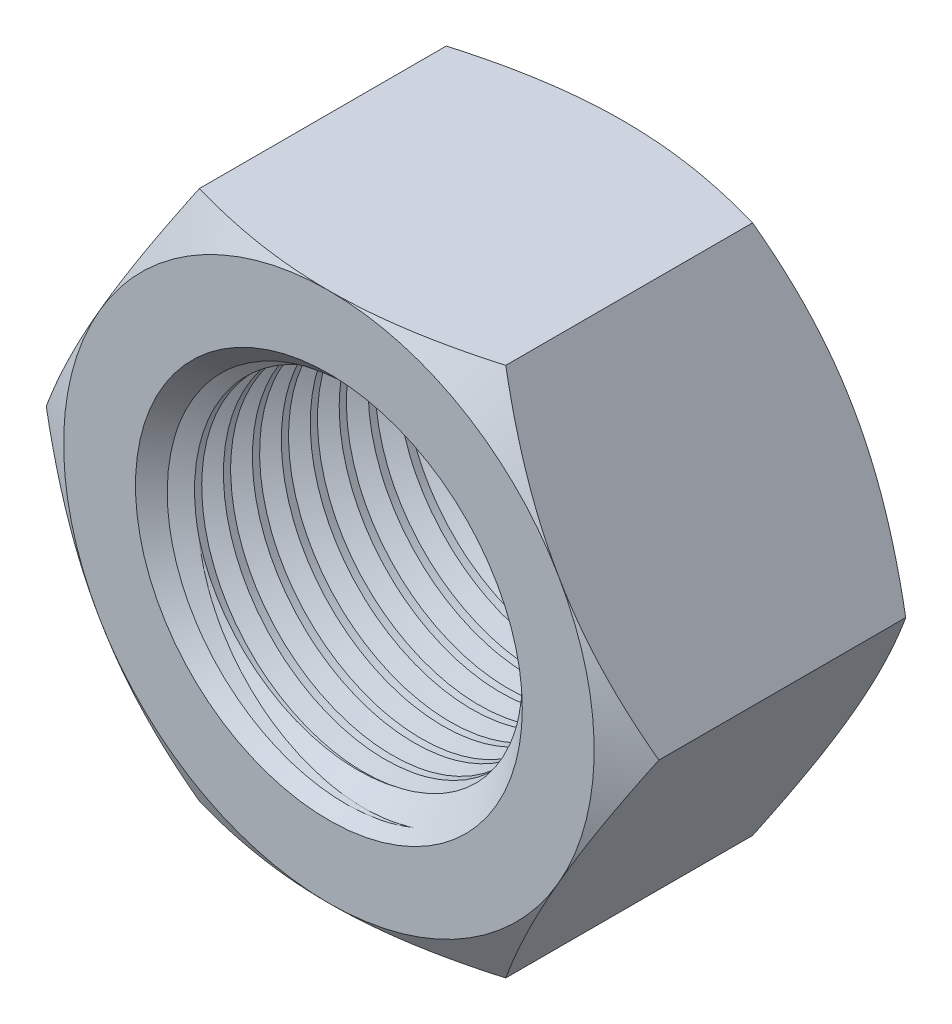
from build123d import *

# Parameters (mm, degrees)
Y_KSEKLIK_EKSTR_ZYON1_DEPTH = 61
IZIM2_OUTSIDE_W             = 376.08
IZIM2_OUTSIDE_H             = 359.062
IZIM2_OUTSIDE_R             = 55
KES_EKSTR_ZYON1_DEPTH       = 61
KES_EKSTR_ZYON1_DRAFT       = -60
IZIM3_OUTSIDE_W             = 376.08
IZIM3_OUTSIDE_H             = 359.062
IZIM3_OUTSIDE_R             = 55
KES_EKSTR_ZYON2_DEPTH       = 61
KES_EKSTR_ZYON2_DRAFT       = -60
IZIM4_R                     = 34.1
KES_EKSTR_ZYON3_DEPTH       = 61
PAH1_SIZE                   = 6
KES_S_P_R1_PITCH            = 6
KES_S_P_R1_HEIGHT           = 70
KES_S_P_R1_RADIUS           = 34.1


with BuildPart() as part:
    # izim1 → Y_kseklik-Ekstr_zyon1 (new body)
    with BuildSketch(Plane.XY):
        Polygon((63.508529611, 0), (31.754264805, 55), (-31.754264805, 55), (-63.508529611, 0), (-31.754264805, -55), (31.754264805, -55), align=None)
    extrude(amount=Y_KSEKLIK_EKSTR_ZYON1_DEPTH)


with BuildPart() as kes_ekstr_zyon1_tool:
    # izim2 outside → Kes-Ekstr_zyon1 (with draft: the straight prism first)
    with BuildSketch(Plane.XY.offset(61)):
        Rectangle(IZIM2_OUTSIDE_W, IZIM2_OUTSIDE_H)
        Circle(IZIM2_OUTSIDE_R, mode=Mode.SUBTRACT)
    extrude(amount=-KES_EKSTR_ZYON1_DEPTH)
    # Kes-Ekstr_zyon1: the draft: its side faces are tilted about the plane it starts from
    kes_ekstr_zyon1_sides = [kes_ekstr_zyon1_tool.faces().sort_by_distance(p)[0] for p in [
        (0, -179.531, 30.5),
        (188.04, 0, 30.5),
        (0, 179.531, 30.5),
        (-188.04, 0, 30.5),
        (-55, 0, 30.5),
    ]]
    draft(kes_ekstr_zyon1_sides, Plane.XY.offset(61), KES_EKSTR_ZYON1_DRAFT)


with BuildPart() as part_1:
    add(part.part)

    # Kes-Ekstr_zyon1: cut by kes_ekstr_zyon1_tool
    add(kes_ekstr_zyon1_tool.part, mode=Mode.SUBTRACT)


with BuildPart() as kes_ekstr_zyon2_tool:
    # izim3 outside → Kes-Ekstr_zyon2 (with draft: the straight prism first)
    with BuildSketch(Plane(origin=(0, 0, 0), x_dir=(-1, 0, 0), z_dir=(0, 0, -1))):
        Rectangle(IZIM3_OUTSIDE_W, IZIM3_OUTSIDE_H)
        Circle(IZIM3_OUTSIDE_R, mode=Mode.SUBTRACT)
    extrude(amount=-KES_EKSTR_ZYON2_DEPTH)
    # Kes-Ekstr_zyon2: the draft: its side faces are tilted about the plane it starts from
    kes_ekstr_zyon2_sides = [kes_ekstr_zyon2_tool.faces().sort_by_distance(p)[0] for p in [
        (0, -179.531, 30.5),
        (-188.04, 0, 30.5),
        (0, 179.531, 30.5),
        (188.04, 0, 30.5),
        (55, 0, 30.5),
    ]]
    draft(kes_ekstr_zyon2_sides, Plane(origin=(0, 0, 0), x_dir=(-1, 0, 0), z_dir=(0, 0, -1)), KES_EKSTR_ZYON2_DRAFT)


with BuildPart() as part_2:
    add(part_1.part)

    # Kes-Ekstr_zyon2: cut by kes_ekstr_zyon2_tool
    add(kes_ekstr_zyon2_tool.part, mode=Mode.SUBTRACT)

    # izim4 → Kes-Ekstr_zyon3 (cut)
    with BuildSketch(Plane.XY.offset(61)):
        Circle(IZIM4_R)
    extrude(amount=-KES_EKSTR_ZYON3_DEPTH, mode=Mode.SUBTRACT)

    # Pah1
    pah1_edges = [part_2.edges().sort_by_distance(p)[0] for p in [
        (-34.1, 0, 0),
        (-34.1, 0, 61),
    ]]
    chamfer(pah1_edges, length=PAH1_SIZE)

    # Kes-S_p_r1: sweep along a helix
    with BuildLine() as kes_s_p_r1_path:
        Helix(KES_S_P_R1_PITCH, KES_S_P_R1_HEIGHT, KES_S_P_R1_RADIUS, center=(0, 0, 0), direction=(0, 0, 1))
    # izim6 → Kes-S_p_r1 (sweep, cut)
    with BuildSketch(Plane(origin=(-17.05, -29.531466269, 70), x_dir=(0.024242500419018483, -0.01399641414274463, -0.9996081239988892), z_dir=(0.8656860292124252, -0.4998040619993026, 0.02799282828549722))):
        Polygon((-2.979180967, 1.2600928), (2.979180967, 1.2600928), (0, -3.9), align=None)
    sweep(path=kes_s_p_r1_path.line, is_frenet=True, mode=Mode.SUBTRACT)


solid = part_2.part
